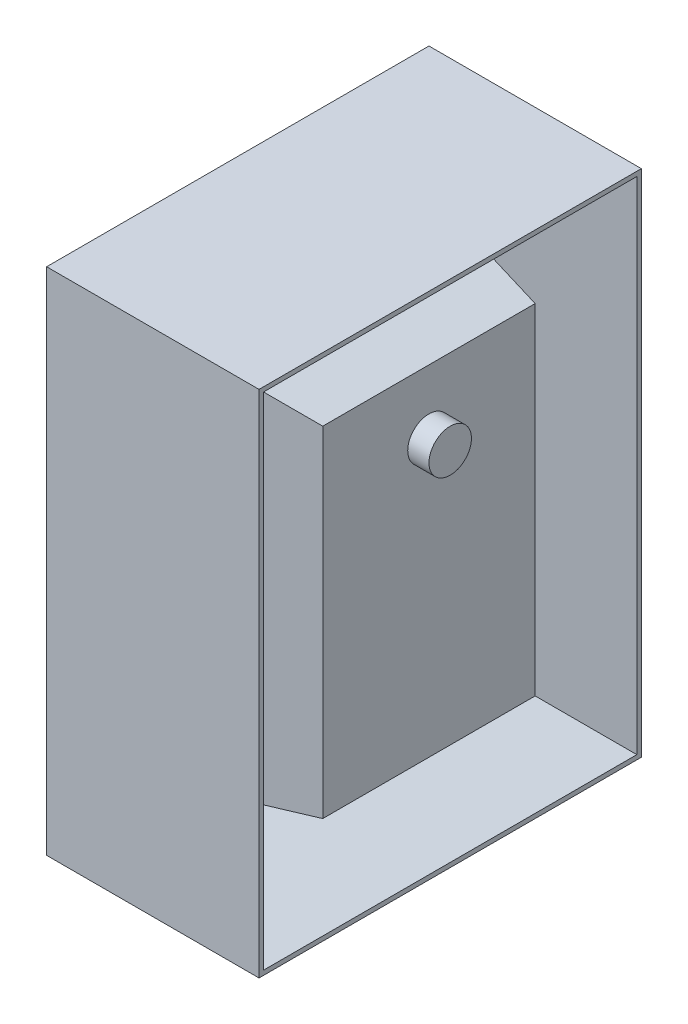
ISO-10303-21;
HEADER;
FILE_DESCRIPTION(('STEP AP214'),'2;1');
FILE_NAME('part.step','',(''),(''),'','','');
FILE_SCHEMA(('AUTOMOTIVE_DESIGN { 1 0 10303 214 1 1 1 1 }'));
ENDSEC;
DATA;
#1=APPLICATION_CONTEXT('core data for automotive mechanical design processes');
#2=APPLICATION_PROTOCOL_DEFINITION('international standard','automotive_design',2000,#1);
#3=PRODUCT_CONTEXT('',#1,'mechanical');
#4=PRODUCT('Part','Part','',(#3));
#5=PRODUCT_RELATED_PRODUCT_CATEGORY('part','',(#4));
#6=PRODUCT_DEFINITION_FORMATION('','',#4);
#7=PRODUCT_DEFINITION_CONTEXT('part definition',#1,'design');
#8=PRODUCT_DEFINITION('design','',#6,#7);
#9=PRODUCT_DEFINITION_SHAPE('','',#8);
#10=(LENGTH_UNIT() NAMED_UNIT(*) SI_UNIT(.MILLI.,.METRE.));
#11=(NAMED_UNIT(*) PLANE_ANGLE_UNIT() SI_UNIT($,.RADIAN.));
#12=(NAMED_UNIT(*) SI_UNIT($,.STERADIAN.) SOLID_ANGLE_UNIT());
#13=UNCERTAINTY_MEASURE_WITH_UNIT(LENGTH_MEASURE(1.E-05),#10,'distance_accuracy_value','');
#14=(GEOMETRIC_REPRESENTATION_CONTEXT(3) GLOBAL_UNCERTAINTY_ASSIGNED_CONTEXT((#13)) GLOBAL_UNIT_ASSIGNED_CONTEXT((#10,
#11,#12)) REPRESENTATION_CONTEXT('',''));
#15=CARTESIAN_POINT('',(0.,0.,0.));
#16=DIRECTION('',(0.,0.,1.));
#17=DIRECTION('',(1.,0.,0.));
#18=AXIS2_PLACEMENT_3D('',#15,#16,#17);
#19=CARTESIAN_POINT('',(5.,0.,0.));
#20=DIRECTION('',(1.,0.,0.));
#21=DIRECTION('',(0.,0.,-1.));
#22=AXIS2_PLACEMENT_3D('',#19,#20,#21);
#23=PLANE('',#22);
#24=DIRECTION('',(0.,-1.,0.));
#25=VECTOR('',#24,1.);
#26=CARTESIAN_POINT('',(5.,111.,81.));
#27=LINE('',#26,#25);
#28=CARTESIAN_POINT('',(5.,111.,81.));
#29=VERTEX_POINT('',#28);
#30=CARTESIAN_POINT('',(5.,9.,81.));
#31=VERTEX_POINT('',#30);
#32=EDGE_CURVE('E132',#29,#31,#27,.T.);
#33=ORIENTED_EDGE('',*,*,#32,.T.);
#34=DIRECTION('',(0.,0.,-1.));
#35=VECTOR('',#34,1.);
#36=CARTESIAN_POINT('',(5.,9.,81.));
#37=LINE('',#36,#35);
#38=CARTESIAN_POINT('',(5.,9.,8.99999999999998));
#39=VERTEX_POINT('',#38);
#40=EDGE_CURVE('E204',#31,#39,#37,.T.);
#41=ORIENTED_EDGE('',*,*,#40,.T.);
#42=DIRECTION('',(0.,1.,0.));
#43=VECTOR('',#42,1.);
#44=CARTESIAN_POINT('',(5.,111.,8.99999999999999));
#45=LINE('',#44,#43);
#46=CARTESIAN_POINT('',(5.,111.,8.99999999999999));
#47=VERTEX_POINT('',#46);
#48=EDGE_CURVE('E207',#39,#47,#45,.T.);
#49=ORIENTED_EDGE('',*,*,#48,.T.);
#50=DIRECTION('',(0.,0.,1.));
#51=VECTOR('',#50,1.);
#52=CARTESIAN_POINT('',(5.,111.,81.));
#53=LINE('',#52,#51);
#54=EDGE_CURVE('E183',#47,#29,#53,.T.);
#55=ORIENTED_EDGE('',*,*,#54,.T.);
#56=EDGE_LOOP('',(#33,#41,#49,#55));
#57=FACE_BOUND('',#56,.T.);
#58=DIRECTION('',(0.,0.,-1.));
#59=VECTOR('',#58,1.);
#60=CARTESIAN_POINT('',(5.,107.053079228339,70.));
#61=LINE('',#60,#59);
#62=CARTESIAN_POINT('',(5.,107.053079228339,12.9469207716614));
#63=VERTEX_POINT('',#62);
#64=CARTESIAN_POINT('',(5.,107.053079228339,77.0530792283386));
#65=VERTEX_POINT('',#64);
#66=EDGE_CURVE('E123',#63,#65,#61,.F.);
#67=ORIENTED_EDGE('',*,*,#66,.F.);
#68=DIRECTION('',(0.,-1.,0.));
#69=VECTOR('',#68,1.);
#70=CARTESIAN_POINT('',(5.,20.,12.9469207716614));
#71=LINE('',#70,#69);
#72=CARTESIAN_POINT('',(5.,12.9469207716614,12.9469207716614));
#73=VERTEX_POINT('',#72);
#74=EDGE_CURVE('E137',#73,#63,#71,.F.);
#75=ORIENTED_EDGE('',*,*,#74,.F.);
#76=DIRECTION('',(0.,0.,1.));
#77=VECTOR('',#76,1.);
#78=CARTESIAN_POINT('',(5.,12.9469207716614,70.));
#79=LINE('',#78,#77);
#80=CARTESIAN_POINT('',(5.,12.9469207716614,77.0530792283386));
#81=VERTEX_POINT('',#80);
#82=EDGE_CURVE('E151',#81,#73,#79,.F.);
#83=ORIENTED_EDGE('',*,*,#82,.F.);
#84=DIRECTION('',(0.,1.,0.));
#85=VECTOR('',#84,1.);
#86=CARTESIAN_POINT('',(5.,20.,77.0530792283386));
#87=LINE('',#86,#85);
#88=EDGE_CURVE('E147',#65,#81,#87,.F.);
#89=ORIENTED_EDGE('',*,*,#88,.F.);
#90=EDGE_LOOP('',(#67,#75,#83,#89));
#91=FACE_BOUND('',#90,.T.);
#92=ADVANCED_FACE('F39',(#57,#91),#23,.T.);
#93=CARTESIAN_POINT('',(5.,0.,0.));
#94=DIRECTION('',(0.,0.,1.));
#95=DIRECTION('',(0.,-1.,0.));
#96=AXIS2_PLACEMENT_3D('',#93,#94,#95);
#97=PLANE('',#96);
#98=DIRECTION('',(0.,1.,0.));
#99=VECTOR('',#98,1.);
#100=CARTESIAN_POINT('',(0.,0.,0.));
#101=LINE('',#100,#99);
#102=CARTESIAN_POINT('',(0.,0.,0.));
#103=VERTEX_POINT('',#102);
#104=CARTESIAN_POINT('',(0.,120.,0.));
#105=VERTEX_POINT('',#104);
#106=EDGE_CURVE('E232',#103,#105,#101,.T.);
#107=ORIENTED_EDGE('',*,*,#106,.T.);
#108=DIRECTION('',(-1.,0.,0.));
#109=VECTOR('',#108,1.);
#110=CARTESIAN_POINT('',(5.,120.,0.));
#111=LINE('',#110,#109);
#112=CARTESIAN_POINT('',(50.,120.,0.));
#113=VERTEX_POINT('',#112);
#114=EDGE_CURVE('E49',#113,#105,#111,.T.);
#115=ORIENTED_EDGE('',*,*,#114,.F.);
#116=DIRECTION('',(0.,1.,0.));
#117=VECTOR('',#116,1.);
#118=CARTESIAN_POINT('',(50.,120.,0.));
#119=LINE('',#118,#117);
#120=CARTESIAN_POINT('',(50.,0.,0.));
#121=VERTEX_POINT('',#120);
#122=EDGE_CURVE('E225',#121,#113,#119,.T.);
#123=ORIENTED_EDGE('',*,*,#122,.F.);
#124=DIRECTION('',(-1.,0.,0.));
#125=VECTOR('',#124,1.);
#126=CARTESIAN_POINT('',(5.,0.,0.));
#127=LINE('',#126,#125);
#128=EDGE_CURVE('E245',#121,#103,#127,.T.);
#129=ORIENTED_EDGE('',*,*,#128,.T.);
#130=EDGE_LOOP('',(#107,#115,#123,#129));
#131=FACE_BOUND('',#130,.T.);
#132=ADVANCED_FACE('F309',(#131),#97,.F.);
#133=CARTESIAN_POINT('',(5.,120.,0.));
#134=DIRECTION('',(0.,-1.,0.));
#135=DIRECTION('',(0.,0.,-1.));
#136=AXIS2_PLACEMENT_3D('',#133,#134,#135);
#137=PLANE('',#136);
#138=DIRECTION('',(0.,0.,1.));
#139=VECTOR('',#138,1.);
#140=CARTESIAN_POINT('',(0.,120.,0.));
#141=LINE('',#140,#139);
#142=CARTESIAN_POINT('',(0.,120.,90.));
#143=VERTEX_POINT('',#142);
#144=EDGE_CURVE('E236',#105,#143,#141,.T.);
#145=ORIENTED_EDGE('',*,*,#144,.T.);
#146=DIRECTION('',(-1.,0.,0.));
#147=VECTOR('',#146,1.);
#148=CARTESIAN_POINT('',(5.,120.,90.));
#149=LINE('',#148,#147);
#150=CARTESIAN_POINT('',(50.,120.,90.));
#151=VERTEX_POINT('',#150);
#152=EDGE_CURVE('E96',#151,#143,#149,.T.);
#153=ORIENTED_EDGE('',*,*,#152,.F.);
#154=DIRECTION('',(0.,0.,1.));
#155=VECTOR('',#154,1.);
#156=CARTESIAN_POINT('',(50.,120.,90.));
#157=LINE('',#156,#155);
#158=EDGE_CURVE('E229',#113,#151,#157,.T.);
#159=ORIENTED_EDGE('',*,*,#158,.F.);
#160=ORIENTED_EDGE('',*,*,#114,.T.);
#161=EDGE_LOOP('',(#145,#153,#159,#160));
#162=FACE_BOUND('',#161,.T.);
#163=ADVANCED_FACE('F310',(#162),#137,.F.);
#164=CARTESIAN_POINT('',(5.,0.,90.));
#165=DIRECTION('',(0.,0.,-1.));
#166=DIRECTION('',(-1.,0.,0.));
#167=AXIS2_PLACEMENT_3D('',#164,#165,#166);
#168=PLANE('',#167);
#169=DIRECTION('',(0.,-1.,0.));
#170=VECTOR('',#169,1.);
#171=CARTESIAN_POINT('',(0.,0.,90.));
#172=LINE('',#171,#170);
#173=CARTESIAN_POINT('',(0.,0.,90.));
#174=VERTEX_POINT('',#173);
#175=EDGE_CURVE('E239',#143,#174,#172,.T.);
#176=ORIENTED_EDGE('',*,*,#175,.T.);
#177=DIRECTION('',(-1.,0.,0.));
#178=VECTOR('',#177,1.);
#179=CARTESIAN_POINT('',(5.,0.,90.));
#180=LINE('',#179,#178);
#181=CARTESIAN_POINT('',(50.,0.,90.));
#182=VERTEX_POINT('',#181);
#183=EDGE_CURVE('E249',#182,#174,#180,.T.);
#184=ORIENTED_EDGE('',*,*,#183,.F.);
#185=DIRECTION('',(0.,-1.,0.));
#186=VECTOR('',#185,1.);
#187=CARTESIAN_POINT('',(50.,120.,90.));
#188=LINE('',#187,#186);
#189=EDGE_CURVE('E163',#151,#182,#188,.T.);
#190=ORIENTED_EDGE('',*,*,#189,.F.);
#191=ORIENTED_EDGE('',*,*,#152,.T.);
#192=EDGE_LOOP('',(#176,#184,#190,#191));
#193=FACE_BOUND('',#192,.T.);
#194=ADVANCED_FACE('F312',(#193),#168,.F.);
#195=CARTESIAN_POINT('',(5.,0.,0.));
#196=DIRECTION('',(0.,1.,0.));
#197=DIRECTION('',(0.,0.,1.));
#198=AXIS2_PLACEMENT_3D('',#195,#196,#197);
#199=PLANE('',#198);
#200=DIRECTION('',(0.,0.,-1.));
#201=VECTOR('',#200,1.);
#202=CARTESIAN_POINT('',(0.,0.,0.));
#203=LINE('',#202,#201);
#204=EDGE_CURVE('E242',#174,#103,#203,.T.);
#205=ORIENTED_EDGE('',*,*,#204,.T.);
#206=ORIENTED_EDGE('',*,*,#128,.F.);
#207=DIRECTION('',(0.,0.,-1.));
#208=VECTOR('',#207,1.);
#209=CARTESIAN_POINT('',(50.,0.,90.));
#210=LINE('',#209,#208);
#211=EDGE_CURVE('E221',#182,#121,#210,.T.);
#212=ORIENTED_EDGE('',*,*,#211,.F.);
#213=ORIENTED_EDGE('',*,*,#183,.T.);
#214=EDGE_LOOP('',(#205,#206,#212,#213));
#215=FACE_BOUND('',#214,.T.);
#216=ADVANCED_FACE('F302',(#215),#199,.F.);
#217=CARTESIAN_POINT('',(0.,0.,0.));
#218=DIRECTION('',(1.,0.,0.));
#219=DIRECTION('',(0.,0.,-1.));
#220=AXIS2_PLACEMENT_3D('',#217,#218,#219);
#221=PLANE('',#220);
#222=ORIENTED_EDGE('',*,*,#106,.F.);
#223=ORIENTED_EDGE('',*,*,#204,.F.);
#224=ORIENTED_EDGE('',*,*,#175,.F.);
#225=ORIENTED_EDGE('',*,*,#144,.F.);
#226=EDGE_LOOP('',(#222,#223,#224,#225));
#227=FACE_BOUND('',#226,.T.);
#228=ADVANCED_FACE('F315',(#227),#221,.F.);
#229=CARTESIAN_POINT('',(50.,0.,0.));
#230=DIRECTION('',(1.,0.,0.));
#231=DIRECTION('',(0.,0.,-1.));
#232=AXIS2_PLACEMENT_3D('',#229,#230,#231);
#233=PLANE('',#232);
#234=ORIENTED_EDGE('',*,*,#189,.T.);
#235=ORIENTED_EDGE('',*,*,#211,.T.);
#236=ORIENTED_EDGE('',*,*,#122,.T.);
#237=ORIENTED_EDGE('',*,*,#158,.T.);
#238=EDGE_LOOP('',(#234,#235,#236,#237));
#239=FACE_BOUND('',#238,.T.);
#240=DIRECTION('',(0.,0.,-1.));
#241=VECTOR('',#240,1.);
#242=CARTESIAN_POINT('',(50.,1.06528586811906,81.));
#243=LINE('',#242,#241);
#244=CARTESIAN_POINT('',(50.,1.06528586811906,88.9347141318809));
#245=VERTEX_POINT('',#244);
#246=CARTESIAN_POINT('',(50.,1.06528586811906,1.06528586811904));
#247=VERTEX_POINT('',#246);
#248=EDGE_CURVE('E175',#245,#247,#243,.T.);
#249=ORIENTED_EDGE('',*,*,#248,.F.);
#250=DIRECTION('',(0.,-1.,0.));
#251=VECTOR('',#250,1.);
#252=CARTESIAN_POINT('',(50.,111.,88.934714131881));
#253=LINE('',#252,#251);
#254=CARTESIAN_POINT('',(50.,118.934714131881,88.934714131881));
#255=VERTEX_POINT('',#254);
#256=EDGE_CURVE('E180',#255,#245,#253,.T.);
#257=ORIENTED_EDGE('',*,*,#256,.F.);
#258=DIRECTION('',(0.,0.,1.));
#259=VECTOR('',#258,1.);
#260=CARTESIAN_POINT('',(50.,118.934714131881,81.));
#261=LINE('',#260,#259);
#262=CARTESIAN_POINT('',(50.,118.934714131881,1.06528586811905));
#263=VERTEX_POINT('',#262);
#264=EDGE_CURVE('E174',#263,#255,#261,.T.);
#265=ORIENTED_EDGE('',*,*,#264,.F.);
#266=DIRECTION('',(0.,1.,0.));
#267=VECTOR('',#266,1.);
#268=CARTESIAN_POINT('',(50.,111.,1.06528586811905));
#269=LINE('',#268,#267);
#270=EDGE_CURVE('E179',#247,#263,#269,.T.);
#271=ORIENTED_EDGE('',*,*,#270,.F.);
#272=EDGE_LOOP('',(#249,#257,#265,#271));
#273=FACE_BOUND('',#272,.T.);
#274=ADVANCED_FACE('F195',(#239,#273),#233,.T.);
#275=CARTESIAN_POINT('',(5.,111.,81.));
#276=DIRECTION('',(0.173648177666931,0.,-0.984807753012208));
#277=DIRECTION('',(-0.984807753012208,0.,-0.173648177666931));
#278=AXIS2_PLACEMENT_3D('',#275,#276,#277);
#279=PLANE('',#278);
#280=ORIENTED_EDGE('',*,*,#32,.F.);
#281=DIRECTION('',(-0.970287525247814,-0.171087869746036,-0.171087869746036));
#282=VECTOR('',#281,1.);
#283=CARTESIAN_POINT('',(5.,111.,81.));
#284=LINE('',#283,#282);
#285=EDGE_CURVE('E170',#255,#29,#284,.T.);
#286=ORIENTED_EDGE('',*,*,#285,.F.);
#287=ORIENTED_EDGE('',*,*,#256,.T.);
#288=DIRECTION('',(-0.970287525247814,0.171087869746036,-0.171087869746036));
#289=VECTOR('',#288,1.);
#290=CARTESIAN_POINT('',(5.,9.,81.));
#291=LINE('',#290,#289);
#292=EDGE_CURVE('E159',#245,#31,#291,.T.);
#293=ORIENTED_EDGE('',*,*,#292,.T.);
#294=EDGE_LOOP('',(#280,#286,#287,#293));
#295=FACE_BOUND('',#294,.T.);
#296=ADVANCED_FACE('F41',(#295),#279,.T.);
#297=CARTESIAN_POINT('',(5.,9.,81.));
#298=DIRECTION('',(0.173648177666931,0.984807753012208,0.));
#299=DIRECTION('',(-0.984807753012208,0.173648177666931,0.));
#300=AXIS2_PLACEMENT_3D('',#297,#298,#299);
#301=PLANE('',#300);
#302=ORIENTED_EDGE('',*,*,#40,.F.);
#303=ORIENTED_EDGE('',*,*,#292,.F.);
#304=ORIENTED_EDGE('',*,*,#248,.T.);
#305=DIRECTION('',(-0.970287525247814,0.171087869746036,0.171087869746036));
#306=VECTOR('',#305,1.);
#307=CARTESIAN_POINT('',(-11.9324514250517,11.9856480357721,11.9856480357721));
#308=LINE('',#307,#306);
#309=EDGE_CURVE('E164',#247,#39,#308,.T.);
#310=ORIENTED_EDGE('',*,*,#309,.T.);
#311=EDGE_LOOP('',(#302,#303,#304,#310));
#312=FACE_BOUND('',#311,.T.);
#313=ADVANCED_FACE('F382',(#312),#301,.T.);
#314=CARTESIAN_POINT('',(5.,111.,8.99999999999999));
#315=DIRECTION('',(0.173648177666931,0.,0.984807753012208));
#316=DIRECTION('',(0.984807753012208,0.,-0.173648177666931));
#317=AXIS2_PLACEMENT_3D('',#314,#315,#316);
#318=PLANE('',#317);
#319=ORIENTED_EDGE('',*,*,#48,.F.);
#320=ORIENTED_EDGE('',*,*,#309,.F.);
#321=ORIENTED_EDGE('',*,*,#270,.T.);
#322=DIRECTION('',(-0.970287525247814,-0.171087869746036,0.171087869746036));
#323=VECTOR('',#322,1.);
#324=CARTESIAN_POINT('',(-6.9523186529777,108.892483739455,11.107516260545));
#325=LINE('',#324,#323);
#326=EDGE_CURVE('E84',#263,#47,#325,.T.);
#327=ORIENTED_EDGE('',*,*,#326,.T.);
#328=EDGE_LOOP('',(#319,#320,#321,#327));
#329=FACE_BOUND('',#328,.T.);
#330=ADVANCED_FACE('F191',(#329),#318,.T.);
#331=CARTESIAN_POINT('',(5.,111.,81.));
#332=DIRECTION('',(0.173648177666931,-0.984807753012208,0.));
#333=DIRECTION('',(0.984807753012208,0.173648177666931,0.));
#334=AXIS2_PLACEMENT_3D('',#331,#332,#333);
#335=PLANE('',#334);
#336=ORIENTED_EDGE('',*,*,#54,.F.);
#337=ORIENTED_EDGE('',*,*,#326,.F.);
#338=ORIENTED_EDGE('',*,*,#264,.T.);
#339=ORIENTED_EDGE('',*,*,#285,.T.);
#340=EDGE_LOOP('',(#336,#337,#338,#339));
#341=FACE_BOUND('',#340,.T.);
#342=ADVANCED_FACE('F197',(#341),#335,.T.);
#343=CARTESIAN_POINT('',(45.,20.,20.));
#344=DIRECTION('',(0.173648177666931,0.,-0.984807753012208));
#345=DIRECTION('',(-0.984807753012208,0.,-0.173648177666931));
#346=AXIS2_PLACEMENT_3D('',#343,#344,#345);
#347=PLANE('',#346);
#348=ORIENTED_EDGE('',*,*,#74,.T.);
#349=DIRECTION('',(-0.970287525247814,0.171087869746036,-0.171087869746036));
#350=VECTOR('',#349,1.);
#351=CARTESIAN_POINT('',(53.3002212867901,98.5364470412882,21.4635529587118));
#352=LINE('',#351,#350);
#353=CARTESIAN_POINT('',(45.,100.,20.));
#354=VERTEX_POINT('',#353);
#355=EDGE_CURVE('E118',#354,#63,#352,.T.);
#356=ORIENTED_EDGE('',*,*,#355,.F.);
#357=DIRECTION('',(0.,1.,0.));
#358=VECTOR('',#357,1.);
#359=CARTESIAN_POINT('',(45.,20.,20.));
#360=LINE('',#359,#358);
#361=CARTESIAN_POINT('',(45.,20.,20.));
#362=VERTEX_POINT('',#361);
#363=EDGE_CURVE('E157',#362,#354,#360,.T.);
#364=ORIENTED_EDGE('',*,*,#363,.F.);
#365=DIRECTION('',(-0.970287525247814,-0.171087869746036,-0.171087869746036));
#366=VECTOR('',#365,1.);
#367=CARTESIAN_POINT('',(45.,20.,20.));
#368=LINE('',#367,#366);
#369=EDGE_CURVE('E140',#362,#73,#368,.T.);
#370=ORIENTED_EDGE('',*,*,#369,.T.);
#371=EDGE_LOOP('',(#348,#356,#364,#370));
#372=FACE_BOUND('',#371,.T.);
#373=ADVANCED_FACE('F138',(#372),#347,.T.);
#374=CARTESIAN_POINT('',(45.,100.,70.));
#375=DIRECTION('',(0.173648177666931,0.984807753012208,0.));
#376=DIRECTION('',(-0.984807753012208,0.173648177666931,0.));
#377=AXIS2_PLACEMENT_3D('',#374,#375,#376);
#378=PLANE('',#377);
#379=ORIENTED_EDGE('',*,*,#66,.T.);
#380=DIRECTION('',(-0.970287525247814,0.171087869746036,0.171087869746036));
#381=VECTOR('',#380,1.);
#382=CARTESIAN_POINT('',(58.2803540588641,97.6583152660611,67.6583152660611));
#383=LINE('',#382,#381);
#384=CARTESIAN_POINT('',(45.,100.,70.));
#385=VERTEX_POINT('',#384);
#386=EDGE_CURVE('E133',#385,#65,#383,.T.);
#387=ORIENTED_EDGE('',*,*,#386,.F.);
#388=DIRECTION('',(0.,0.,1.));
#389=VECTOR('',#388,1.);
#390=CARTESIAN_POINT('',(45.,100.,70.));
#391=LINE('',#390,#389);
#392=EDGE_CURVE('E127',#354,#385,#391,.T.);
#393=ORIENTED_EDGE('',*,*,#392,.F.);
#394=ORIENTED_EDGE('',*,*,#355,.T.);
#395=EDGE_LOOP('',(#379,#387,#393,#394));
#396=FACE_BOUND('',#395,.T.);
#397=ADVANCED_FACE('F120',(#396),#378,.T.);
#398=CARTESIAN_POINT('',(45.,20.,70.));
#399=DIRECTION('',(0.173648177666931,0.,0.984807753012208));
#400=DIRECTION('',(0.984807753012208,0.,-0.173648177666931));
#401=AXIS2_PLACEMENT_3D('',#398,#399,#400);
#402=PLANE('',#401);
#403=ORIENTED_EDGE('',*,*,#88,.T.);
#404=DIRECTION('',(-0.970287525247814,-0.171087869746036,0.171087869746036));
#405=VECTOR('',#404,1.);
#406=CARTESIAN_POINT('',(45.,20.,70.));
#407=LINE('',#406,#405);
#408=CARTESIAN_POINT('',(45.,20.,70.));
#409=VERTEX_POINT('',#408);
#410=EDGE_CURVE('E57',#409,#81,#407,.T.);
#411=ORIENTED_EDGE('',*,*,#410,.F.);
#412=DIRECTION('',(0.,-1.,0.));
#413=VECTOR('',#412,1.);
#414=CARTESIAN_POINT('',(45.,20.,70.));
#415=LINE('',#414,#413);
#416=EDGE_CURVE('E263',#385,#409,#415,.T.);
#417=ORIENTED_EDGE('',*,*,#416,.F.);
#418=ORIENTED_EDGE('',*,*,#386,.T.);
#419=EDGE_LOOP('',(#403,#411,#417,#418));
#420=FACE_BOUND('',#419,.T.);
#421=ADVANCED_FACE('F352',(#420),#402,.T.);
#422=CARTESIAN_POINT('',(45.,20.,70.));
#423=DIRECTION('',(0.173648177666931,-0.984807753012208,0.));
#424=DIRECTION('',(0.984807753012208,0.173648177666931,0.));
#425=AXIS2_PLACEMENT_3D('',#422,#423,#424);
#426=PLANE('',#425);
#427=ORIENTED_EDGE('',*,*,#82,.T.);
#428=ORIENTED_EDGE('',*,*,#369,.F.);
#429=DIRECTION('',(0.,0.,-1.));
#430=VECTOR('',#429,1.);
#431=CARTESIAN_POINT('',(45.,20.,70.));
#432=LINE('',#431,#430);
#433=EDGE_CURVE('E210',#409,#362,#432,.T.);
#434=ORIENTED_EDGE('',*,*,#433,.F.);
#435=ORIENTED_EDGE('',*,*,#410,.T.);
#436=EDGE_LOOP('',(#427,#428,#434,#435));
#437=FACE_BOUND('',#436,.T.);
#438=ADVANCED_FACE('F289',(#437),#426,.T.);
#439=CARTESIAN_POINT('',(45.,0.,0.));
#440=DIRECTION('',(-1.,0.,0.));
#441=DIRECTION('',(0.,0.,1.));
#442=AXIS2_PLACEMENT_3D('',#439,#440,#441);
#443=PLANE('',#442);
#444=CARTESIAN_POINT('',(45.,85.,45.));
#445=DIRECTION('',(-1.,0.,0.));
#446=DIRECTION('',(0.,0.,1.));
#447=AXIS2_PLACEMENT_3D('',#444,#445,#446);
#448=CIRCLE('',#447,5.);
#449=CARTESIAN_POINT('',(45.,85.,50.));
#450=VERTEX_POINT('',#449);
#451=EDGE_CURVE('E11',#450,#450,#448,.F.);
#452=ORIENTED_EDGE('',*,*,#451,.F.);
#453=EDGE_LOOP('',(#452));
#454=FACE_BOUND('',#453,.T.);
#455=ORIENTED_EDGE('',*,*,#363,.T.);
#456=ORIENTED_EDGE('',*,*,#392,.T.);
#457=ORIENTED_EDGE('',*,*,#416,.T.);
#458=ORIENTED_EDGE('',*,*,#433,.T.);
#459=EDGE_LOOP('',(#455,#456,#457,#458));
#460=FACE_BOUND('',#459,.T.);
#461=ADVANCED_FACE('F284',(#454,#460),#443,.F.);
#462=CARTESIAN_POINT('',(50.,85.,45.));
#463=DIRECTION('',(-1.,0.,0.));
#464=DIRECTION('',(0.,0.,1.));
#465=AXIS2_PLACEMENT_3D('',#462,#463,#464);
#466=CYLINDRICAL_SURFACE('',#465,5.);
#467=CARTESIAN_POINT('',(50.,85.,45.));
#468=DIRECTION('',(1.,0.,0.));
#469=DIRECTION('',(0.,0.,-1.));
#470=AXIS2_PLACEMENT_3D('',#467,#468,#469);
#471=CIRCLE('',#470,5.);
#472=CARTESIAN_POINT('',(50.,85.,40.));
#473=VERTEX_POINT('',#472);
#474=EDGE_CURVE('E144',#473,#473,#471,.T.);
#475=ORIENTED_EDGE('',*,*,#474,.F.);
#476=EDGE_LOOP('',(#475));
#477=FACE_BOUND('',#476,.T.);
#478=ORIENTED_EDGE('',*,*,#451,.T.);
#479=EDGE_LOOP('',(#478));
#480=FACE_BOUND('',#479,.T.);
#481=ADVANCED_FACE('F281',(#477,#480),#466,.T.);
#482=CARTESIAN_POINT('',(50.,85.,45.));
#483=DIRECTION('',(1.,0.,0.));
#484=DIRECTION('',(0.,0.,-1.));
#485=AXIS2_PLACEMENT_3D('',#482,#483,#484);
#486=PLANE('',#485);
#487=ORIENTED_EDGE('',*,*,#474,.T.);
#488=EDGE_LOOP('',(#487));
#489=FACE_BOUND('',#488,.T.);
#490=ADVANCED_FACE('F279',(#489),#486,.T.);
#491=CLOSED_SHELL('',(#92,#132,#163,#194,#216,#228,#274,#296,#313,#330,#342,#373,#397,#421,#438,
#461,#481,#490));
#492=MANIFOLD_SOLID_BREP('B2',#491);
#493=ADVANCED_BREP_SHAPE_REPRESENTATION('',(#18,#492),#14);
#494=SHAPE_DEFINITION_REPRESENTATION(#9,#493);
ENDSEC;
END-ISO-10303-21;
